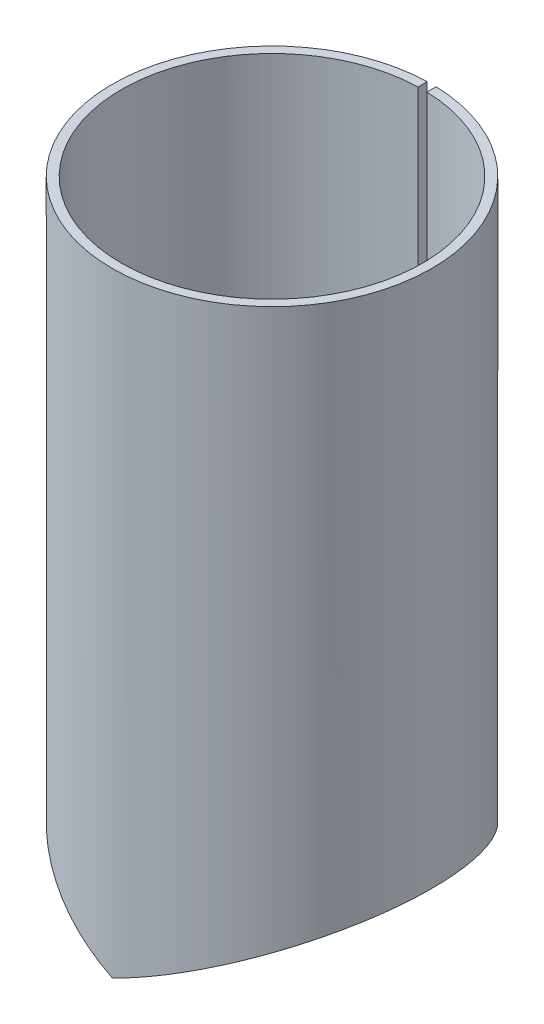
ISO-10303-21;
HEADER;
FILE_DESCRIPTION(('STEP AP214'),'2;1');
FILE_NAME('part.step','',(''),(''),'','','');
FILE_SCHEMA(('AUTOMOTIVE_DESIGN { 1 0 10303 214 1 1 1 1 }'));
ENDSEC;
DATA;
#1=APPLICATION_CONTEXT('core data for automotive mechanical design processes');
#2=APPLICATION_PROTOCOL_DEFINITION('international standard','automotive_design',2000,#1);
#3=PRODUCT_CONTEXT('',#1,'mechanical');
#4=PRODUCT('Part','Part','',(#3));
#5=PRODUCT_RELATED_PRODUCT_CATEGORY('part','',(#4));
#6=PRODUCT_DEFINITION_FORMATION('','',#4);
#7=PRODUCT_DEFINITION_CONTEXT('part definition',#1,'design');
#8=PRODUCT_DEFINITION('design','',#6,#7);
#9=PRODUCT_DEFINITION_SHAPE('','',#8);
#10=(LENGTH_UNIT() NAMED_UNIT(*) SI_UNIT(.MILLI.,.METRE.));
#11=(NAMED_UNIT(*) PLANE_ANGLE_UNIT() SI_UNIT($,.RADIAN.));
#12=(NAMED_UNIT(*) SI_UNIT($,.STERADIAN.) SOLID_ANGLE_UNIT());
#13=UNCERTAINTY_MEASURE_WITH_UNIT(LENGTH_MEASURE(1.E-05),#10,'distance_accuracy_value','');
#14=(GEOMETRIC_REPRESENTATION_CONTEXT(3) GLOBAL_UNCERTAINTY_ASSIGNED_CONTEXT((#13)) GLOBAL_UNIT_ASSIGNED_CONTEXT((#10,
#11,#12)) REPRESENTATION_CONTEXT('',''));
#15=CARTESIAN_POINT('',(0.,0.,0.));
#16=DIRECTION('',(0.,0.,1.));
#17=DIRECTION('',(1.,0.,0.));
#18=AXIS2_PLACEMENT_3D('',#15,#16,#17);
#19=CARTESIAN_POINT('',(0.,67.2886666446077,0.));
#20=DIRECTION('',(0.,-1.,0.));
#21=DIRECTION('',(0.,0.,-1.));
#22=AXIS2_PLACEMENT_3D('',#19,#20,#21);
#23=PLANE('',#22);
#24=DIRECTION('',(0.0285968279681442,0.,-0.999591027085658));
#25=VECTOR('',#24,1.);
#26=CARTESIAN_POINT('',(0.471403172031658,67.2886666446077,-16.4777149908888));
#27=LINE('',#26,#25);
#28=CARTESIAN_POINT('',(0.471403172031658,67.2886666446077,-16.4777149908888));
#29=VERTEX_POINT('',#28);
#30=CARTESIAN_POINT('',(0.499999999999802,67.2886666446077,-17.4773060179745));
#31=VERTEX_POINT('',#30);
#32=EDGE_CURVE('E13',#29,#31,#27,.T.);
#33=ORIENTED_EDGE('',*,*,#32,.F.);
#34=CARTESIAN_POINT('',(0.,67.2886666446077,0.));
#35=DIRECTION('',(0.,1.,0.));
#36=DIRECTION('',(0.,0.,1.));
#37=AXIS2_PLACEMENT_3D('',#34,#35,#36);
#38=CIRCLE('',#37,16.4844566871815);
#39=CARTESIAN_POINT('',(-0.471403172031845,67.2886666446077,-16.4777149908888));
#40=VERTEX_POINT('',#39);
#41=EDGE_CURVE('E85',#40,#29,#38,.T.);
#42=ORIENTED_EDGE('',*,*,#41,.F.);
#43=DIRECTION('',(-0.028596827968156,0.,-0.999591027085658));
#44=VECTOR('',#43,1.);
#45=CARTESIAN_POINT('',(-0.471403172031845,67.2886666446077,-16.4777149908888));
#46=LINE('',#45,#44);
#47=CARTESIAN_POINT('',(-0.499999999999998,67.2886666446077,-17.4773060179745));
#48=VERTEX_POINT('',#47);
#49=EDGE_CURVE('E50',#40,#48,#46,.T.);
#50=ORIENTED_EDGE('',*,*,#49,.T.);
#51=CARTESIAN_POINT('',(0.,67.2886666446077,0.));
#52=DIRECTION('',(0.,-1.,0.));
#53=DIRECTION('',(0.,0.,-1.));
#54=AXIS2_PLACEMENT_3D('',#51,#52,#53);
#55=CIRCLE('',#54,17.4844566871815);
#56=EDGE_CURVE('E87',#48,#31,#55,.F.);
#57=ORIENTED_EDGE('',*,*,#56,.T.);
#58=EDGE_LOOP('',(#33,#42,#50,#57));
#59=FACE_BOUND('',#58,.T.);
#60=ADVANCED_FACE('F38',(#59),#23,.F.);
#61=CARTESIAN_POINT('',(-0.471403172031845,33.7656054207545,-16.4777149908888));
#62=DIRECTION('',(-0.999591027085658,0.,0.028596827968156));
#63=DIRECTION('',(0.,1.,0.));
#64=AXIS2_PLACEMENT_3D('',#61,#62,#63);
#65=PLANE('',#64);
#66=ORIENTED_EDGE('',*,*,#49,.F.);
#67=DIRECTION('',(0.,1.,0.));
#68=VECTOR('',#67,1.);
#69=CARTESIAN_POINT('',(-0.471403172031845,0.242544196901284,-16.4777149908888));
#70=LINE('',#69,#68);
#71=CARTESIAN_POINT('',(-0.471403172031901,0.242544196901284,-16.4777149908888));
#72=VERTEX_POINT('',#71);
#73=EDGE_CURVE('E95',#72,#40,#70,.T.);
#74=ORIENTED_EDGE('',*,*,#73,.F.);
#75=CARTESIAN_POINT('',(-0.50000000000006,0.242544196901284,-17.4773060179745));
#76=CARTESIAN_POINT('',(-0.471403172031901,0.242544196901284,-16.4777149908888));
#77=B_SPLINE_CURVE_WITH_KNOTS('',1,(#75,#76),.UNSPECIFIED.,.F.,.F.,(2,2),(0.,1.),.UNSPECIFIED.);
#78=CARTESIAN_POINT('',(-0.499999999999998,0.242544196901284,-17.4773060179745));
#79=VERTEX_POINT('',#78);
#80=EDGE_CURVE('E225',#72,#79,#77,.F.);
#81=ORIENTED_EDGE('',*,*,#80,.T.);
#82=DIRECTION('',(0.,-1.,0.));
#83=VECTOR('',#82,1.);
#84=CARTESIAN_POINT('',(-0.499999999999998,190.064149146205,-17.4773060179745));
#85=LINE('',#84,#83);
#86=EDGE_CURVE('E156',#79,#48,#85,.F.);
#87=ORIENTED_EDGE('',*,*,#86,.T.);
#88=EDGE_LOOP('',(#66,#74,#81,#87));
#89=FACE_BOUND('',#88,.T.);
#90=ADVANCED_FACE('F191',(#89),#65,.F.);
#91=CARTESIAN_POINT('',(2.15527506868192E-13,2.22044604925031E-13,17.4844566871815));
#92=CARTESIAN_POINT('',(-0.815625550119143,0.395643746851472,17.4844566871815));
#93=CARTESIAN_POINT('',(-1.51365633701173,0.733701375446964,17.4285612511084));
#94=CARTESIAN_POINT('',(-2.38160178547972,1.1549225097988,17.323946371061));
#95=CARTESIAN_POINT('',(-2.64116191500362,1.28099012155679,17.2853956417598));
#96=CARTESIAN_POINT('',(-2.98631097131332,1.44858238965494,17.2279359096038));
#97=CARTESIAN_POINT('',(-3.09399928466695,1.50086162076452,17.2088296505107));
#98=CARTESIAN_POINT('',(-3.29475718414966,1.59825036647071,17.1715236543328));
#99=CARTESIAN_POINT('',(-3.39367810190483,1.64622851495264,17.1522362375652));
#100=CARTESIAN_POINT('',(-4.2770174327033,2.0746414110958,16.9721973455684));
#101=CARTESIAN_POINT('',(-4.99777183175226,2.42416894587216,16.7692832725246));
#102=CARTESIAN_POINT('',(-5.81758003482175,2.82197345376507,16.4891482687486));
#103=CARTESIAN_POINT('',(-5.97750654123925,2.8995791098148,16.4317791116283));
#104=CARTESIAN_POINT('',(-6.28935283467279,3.05087993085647,16.3149621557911));
#105=CARTESIAN_POINT('',(-6.44109429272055,3.12448300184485,16.2556095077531));
#106=CARTESIAN_POINT('',(-6.8918074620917,3.34309130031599,16.0721640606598));
#107=CARTESIAN_POINT('',(-7.18380200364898,3.48469853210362,15.9435715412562));
#108=CARTESIAN_POINT('',(-8.03411540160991,3.89712532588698,15.5419513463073));
#109=CARTESIAN_POINT('',(-8.56669271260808,4.15554998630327,15.253132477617));
#110=CARTESIAN_POINT('',(-9.31464484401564,4.5183971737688,14.7996158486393));
#111=CARTESIAN_POINT('',(-9.5559485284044,4.63542575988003,14.644826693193));
#112=CARTESIAN_POINT('',(-10.0271664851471,4.86397511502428,14.3263056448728));
#113=CARTESIAN_POINT('',(-10.2564168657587,4.97517003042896,14.1629678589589));
#114=CARTESIAN_POINT('',(-10.9250416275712,5.29951549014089,13.6623486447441));
#115=CARTESIAN_POINT('',(-11.3452570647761,5.50342674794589,13.3144829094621));
#116=CARTESIAN_POINT('',(-12.1351979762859,5.88661116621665,12.5987016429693));
#117=CARTESIAN_POINT('',(-12.5068575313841,6.06682578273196,12.2291727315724));
#118=CARTESIAN_POINT('',(-13.2083924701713,6.40712415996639,11.4678907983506));
#119=CARTESIAN_POINT('',(-13.5374742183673,6.56680521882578,11.076849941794));
#120=CARTESIAN_POINT('',(-14.1525595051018,6.86523107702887,10.2793420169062));
#121=CARTESIAN_POINT('',(-14.4385856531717,7.00393810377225,9.87303668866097));
#122=CARTESIAN_POINT('',(-14.9723231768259,7.26280876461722,9.04318239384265));
#123=CARTESIAN_POINT('',(-15.2194123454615,7.38267424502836,8.62039044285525));
#124=CARTESIAN_POINT('',(-15.6740586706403,7.60326550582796,7.76308755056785));
#125=CARTESIAN_POINT('',(-15.8813018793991,7.70385101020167,7.32934947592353));
#126=CARTESIAN_POINT('',(-16.2583398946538,7.88662170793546,6.44992224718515));
#127=CARTESIAN_POINT('',(-16.42823265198,7.96888003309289,6.00379382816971));
#128=CARTESIAN_POINT('',(-16.8813157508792,8.18827393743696,4.65101872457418));
#129=CARTESIAN_POINT('',(-17.1077778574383,8.29802844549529,3.73000996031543));
#130=CARTESIAN_POINT('',(-17.3336854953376,8.40789806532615,2.33886206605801));
#131=CARTESIAN_POINT('',(-17.3900575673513,8.43539424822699,1.87353445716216));
#132=CARTESIAN_POINT('',(-17.4652647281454,8.47213256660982,0.942741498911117));
#133=CARTESIAN_POINT('',(-17.4841075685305,8.48136899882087,0.478005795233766));
#134=CARTESIAN_POINT('',(-17.4851405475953,8.48173838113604,-0.917175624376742));
#135=CARTESIAN_POINT('',(-17.4114515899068,8.4455598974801,-1.85230489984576));
#136=CARTESIAN_POINT('',(-17.1125304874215,8.30035345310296,-3.70823141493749));
#137=CARTESIAN_POINT('',(-16.8872880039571,8.1913254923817,-4.62900688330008));
#138=CARTESIAN_POINT('',(-16.2865314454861,7.90042009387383,-6.43094816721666));
#139=CARTESIAN_POINT('',(-15.912325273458,7.71882463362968,-7.31067360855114));
#140=CARTESIAN_POINT('',(-15.2322190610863,7.38888978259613,-8.59774288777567));
#141=CARTESIAN_POINT('',(-14.9859130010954,7.26943138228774,-9.02060572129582));
#142=CARTESIAN_POINT('',(-14.4542183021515,7.0115543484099,-9.85010098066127));
#143=CARTESIAN_POINT('',(-14.1688110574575,6.87308617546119,-10.256937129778));
#144=CARTESIAN_POINT('',(-13.5547961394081,6.57517706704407,-11.0556532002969));
#145=CARTESIAN_POINT('',(-13.2266404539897,6.41598603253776,-11.446785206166));
#146=CARTESIAN_POINT('',(-12.5279976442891,6.07713100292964,-12.2074642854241));
#147=CARTESIAN_POINT('',(-12.1585707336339,5.89796073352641,-12.5761587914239));
#148=CARTESIAN_POINT('',(-11.3695332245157,5.51512322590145,-13.2937702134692));
#149=CARTESIAN_POINT('',(-10.950429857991,5.31178054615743,-13.641943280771));
#150=CARTESIAN_POINT('',(-10.2846972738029,4.98888063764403,-14.1424292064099));
#151=CARTESIAN_POINT('',(-10.0566145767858,4.87826635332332,-14.3056242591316));
#152=CARTESIAN_POINT('',(-9.58817237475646,4.65107582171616,-14.6237249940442));
#153=CARTESIAN_POINT('',(-9.3472918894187,4.53422860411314,-14.7790239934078));
#154=CARTESIAN_POINT('',(-8.59955297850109,4.17147525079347,-15.2346537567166));
#155=CARTESIAN_POINT('',(-8.06941325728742,3.91431198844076,-15.5234572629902));
#156=CARTESIAN_POINT('',(-7.36719606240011,3.57369829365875,-15.8573273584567));
#157=CARTESIAN_POINT('',(-7.22478075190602,3.50461757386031,-15.9227416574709));
#158=CARTESIAN_POINT('',(-6.93602881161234,3.36454017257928,-16.0506281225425));
#159=CARTESIAN_POINT('',(-6.79013430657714,3.29375565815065,-16.112923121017));
#160=CARTESIAN_POINT('',(-6.34273854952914,3.07666500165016,-16.2966208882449));
#161=CARTESIAN_POINT('',(-6.03135157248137,2.92555633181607,-16.4148402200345));
#162=CARTESIAN_POINT('',(-5.38207535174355,2.61057586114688,-16.6390338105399));
#163=CARTESIAN_POINT('',(-5.04418366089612,2.44670406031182,-16.7450073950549));
#164=CARTESIAN_POINT('',(-4.5175459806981,2.19132401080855,-16.8917498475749));
#165=CARTESIAN_POINT('',(-4.3387031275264,2.1046019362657,-16.9386254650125));
#166=CARTESIAN_POINT('',(-4.06553343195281,1.97212573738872,-17.0054829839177));
#167=CARTESIAN_POINT('',(-3.97365951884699,1.92756815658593,-17.027192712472));
#168=CARTESIAN_POINT('',(-3.78828642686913,1.83765529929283,-17.0693921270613));
#169=CARTESIAN_POINT('',(-3.69586606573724,1.79282765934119,-17.0896607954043));
#170=CARTESIAN_POINT('',(-3.21381146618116,1.55890711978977,-17.1910716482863));
#171=CARTESIAN_POINT('',(-2.76326025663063,1.34004729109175,-17.2725776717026));
#172=CARTESIAN_POINT('',(-1.73012688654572,0.838880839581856,-17.4064415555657));
#173=CARTESIAN_POINT('',(-1.14751221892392,0.556618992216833,-17.4587816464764));
#174=CARTESIAN_POINT('',(-0.50000000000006,0.242544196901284,-17.4773060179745));
#175=CARTESIAN_POINT('',(2.03414633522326E-13,2.22044604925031E-13,16.4844566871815));
#176=CARTESIAN_POINT('',(-0.768971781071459,0.395641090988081,16.4844566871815));
#177=CARTESIAN_POINT('',(-1.42708479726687,0.733701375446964,16.4317581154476));
#178=CARTESIAN_POINT('',(-2.24538927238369,1.1549225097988,16.3331265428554));
#179=CARTESIAN_POINT('',(-2.49010420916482,1.28099012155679,16.2967806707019));
#180=CARTESIAN_POINT('',(-2.81551292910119,1.44858238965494,16.2426072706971));
#181=CARTESIAN_POINT('',(-2.91704215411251,1.50086162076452,16.2245937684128));
#182=CARTESIAN_POINT('',(-3.10631797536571,1.59825036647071,16.1894214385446));
#183=CARTESIAN_POINT('',(-3.19958124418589,1.64622851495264,16.1712371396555));
#184=CARTESIAN_POINT('',(-4.03239916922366,2.0746414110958,16.0014953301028));
#185=CARTESIAN_POINT('',(-4.71193098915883,2.42416894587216,15.8101866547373));
#186=CARTESIAN_POINT('',(-5.4848513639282,2.82197345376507,15.546073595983));
#187=CARTESIAN_POINT('',(-5.63563108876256,2.8995791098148,15.4919855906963));
#188=CARTESIAN_POINT('',(-5.92964175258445,3.05087993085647,15.3818498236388));
#189=CARTESIAN_POINT('',(-6.07270456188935,3.12448300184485,15.3258917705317));
#190=CARTESIAN_POINT('',(-6.49763979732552,3.34309130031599,15.1529382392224));
#191=CARTESIAN_POINT('',(-6.77293410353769,3.48469853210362,15.0317003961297));
#192=CARTESIAN_POINT('',(-7.57461496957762,3.89712532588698,14.6530503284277));
#193=CARTESIAN_POINT('',(-8.07673223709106,4.15554998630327,14.3807500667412));
#194=CARTESIAN_POINT('',(-8.78190625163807,4.5183971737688,13.9531717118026));
#195=CARTESIAN_POINT('',(-9.00940889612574,4.63542575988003,13.8072355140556));
#196=CARTESIAN_POINT('',(-9.45367617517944,4.86397511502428,13.5069318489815));
#197=CARTESIAN_POINT('',(-9.66981488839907,4.97517003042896,13.3529359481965));
#198=CARTESIAN_POINT('',(-10.300198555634,5.29951549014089,12.8809489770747));
#199=CARTESIAN_POINT('',(-10.6963803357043,5.50342674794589,12.5529789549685));
#200=CARTESIAN_POINT('',(-11.4411416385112,5.88661116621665,11.8781358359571));
#201=CARTESIAN_POINT('',(-11.7915446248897,6.06682578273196,11.5297416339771));
#202=CARTESIAN_POINT('',(-12.4529562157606,6.40712415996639,10.8120001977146));
#203=CARTESIAN_POINT('',(-12.7632165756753,6.56680521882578,10.4433243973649));
#204=CARTESIAN_POINT('',(-13.3431228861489,6.86523107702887,9.69142886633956));
#205=CARTESIAN_POINT('',(-13.6127901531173,7.00393810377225,9.30836162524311));
#206=CARTESIAN_POINT('',(-14.1160012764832,7.26280876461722,8.5259697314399));
#207=CARTESIAN_POINT('',(-14.3489585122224,7.38267424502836,8.12735879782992));
#208=CARTESIAN_POINT('',(-14.7776019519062,7.60326550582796,7.31908819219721));
#209=CARTESIAN_POINT('',(-14.972992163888,7.70385101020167,6.91015718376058));
#210=CARTESIAN_POINT('',(-15.3284659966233,7.88662170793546,6.08102761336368));
#211=CARTESIAN_POINT('',(-15.488641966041,7.96888003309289,5.66041490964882));
#212=CARTESIAN_POINT('',(-15.9158115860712,8.18827393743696,4.38500995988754));
#213=CARTESIAN_POINT('',(-16.1293214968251,8.29802844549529,3.51667705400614));
#214=CARTESIAN_POINT('',(-16.342308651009,8.40789806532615,2.2050939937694));
#215=CARTESIAN_POINT('',(-16.3954565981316,8.43539424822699,1.76638017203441));
#216=CARTESIAN_POINT('',(-16.4663623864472,8.47213256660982,0.888822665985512));
#217=CARTESIAN_POINT('',(-16.4841275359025,8.48136899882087,0.450666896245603));
#218=CARTESIAN_POINT('',(-16.4851014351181,8.48173838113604,-0.864718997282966));
#219=CARTESIAN_POINT('',(-16.4156270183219,8.4455598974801,-1.74636481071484));
#220=CARTESIAN_POINT('',(-16.1338023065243,8.30035345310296,-3.49614410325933));
#221=CARTESIAN_POINT('',(-15.9214422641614,8.1913254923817,-4.36425705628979));
#222=CARTESIAN_POINT('',(-15.355045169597,7.90042009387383,-6.06313873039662));
#223=CARTESIAN_POINT('',(-15.0022412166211,7.71882463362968,-6.89254945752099));
#224=CARTESIAN_POINT('',(-14.36103276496,7.38888978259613,-8.10600653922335));
#225=CARTESIAN_POINT('',(-14.1288138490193,7.26943138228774,-8.5046843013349));
#226=CARTESIAN_POINT('',(-13.6275287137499,7.0115543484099,-9.2867376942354));
#227=CARTESIAN_POINT('',(-13.3584449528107,6.87308617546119,-9.67030539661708));
#228=CARTESIAN_POINT('',(-12.779547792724,6.57517706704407,-10.423339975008));
#229=CARTESIAN_POINT('',(-12.470160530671,6.41598603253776,-10.7921017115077));
#230=CARTESIAN_POINT('',(-11.8114756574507,6.07713100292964,-11.5092747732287));
#231=CARTESIAN_POINT('',(-11.4631776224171,5.89796073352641,-11.8568822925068));
#232=CARTESIAN_POINT('',(-10.7192680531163,5.51512322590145,-12.5334508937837));
#233=CARTESIAN_POINT('',(-10.3241347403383,5.31178054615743,-12.8617106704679));
#234=CARTESIAN_POINT('',(-9.69647783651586,4.98888063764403,-13.3335719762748));
#235=CARTESIAN_POINT('',(-9.48144002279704,4.87826635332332,-13.4874333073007));
#236=CARTESIAN_POINT('',(-9.03978974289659,4.65107582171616,-13.7873406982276));
#237=CARTESIAN_POINT('',(-8.81268609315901,4.53422860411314,-13.9337575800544));
#238=CARTESIAN_POINT('',(-8.10771310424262,4.17147525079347,-14.3633282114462));
#239=CARTESIAN_POINT('',(-7.60789401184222,3.91431198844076,-14.6356139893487));
#240=CARTESIAN_POINT('',(-6.94583918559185,3.57369829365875,-14.9503888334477));
#241=CARTESIAN_POINT('',(-6.81156912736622,3.50461757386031,-15.0120618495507));
#242=CARTESIAN_POINT('',(-6.53933196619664,3.36454017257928,-15.1326340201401));
#243=CARTESIAN_POINT('',(-6.40178170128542,3.29375565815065,-15.1913661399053));
#244=CARTESIAN_POINT('',(-5.97997414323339,3.07666500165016,-15.3645575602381));
#245=CARTESIAN_POINT('',(-5.68639652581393,2.92555633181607,-15.4760154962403));
#246=CARTESIAN_POINT('',(-5.07425478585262,2.61057586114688,-15.6873866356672));
#247=CARTESIAN_POINT('',(-4.75568835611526,2.44670406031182,-15.7872992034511));
#248=CARTESIAN_POINT('',(-4.25917101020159,2.19132401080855,-15.9256489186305));
#249=CARTESIAN_POINT('',(-4.09055683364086,2.1046019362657,-15.9698435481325));
#250=CARTESIAN_POINT('',(-3.83301071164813,1.97212573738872,-16.0328772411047));
#251=CARTESIAN_POINT('',(-3.74639140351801,1.92756815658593,-16.0533453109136));
#252=CARTESIAN_POINT('',(-3.57162047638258,1.83765529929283,-16.0931311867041));
#253=CARTESIAN_POINT('',(-3.48448597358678,1.79282765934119,-16.1122406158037));
#254=CARTESIAN_POINT('',(-3.03000183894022,1.55890711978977,-16.2078514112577));
#255=CARTESIAN_POINT('',(-2.60521930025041,1.34004729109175,-16.284695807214));
#256=CARTESIAN_POINT('',(-1.63117460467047,0.838880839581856,-16.4109035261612));
#257=CARTESIAN_POINT('',(-1.08187977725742,0.556617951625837,-16.4602501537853));
#258=CARTESIAN_POINT('',(-0.471403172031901,0.242544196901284,-16.4777149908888));
#259=B_SPLINE_SURFACE_WITH_KNOTS('',1,3,((#91,#92,#93,#94,#95,#96,#97,#98,#99,#100,#101,#102,
#103,#104,#105,#106,#107,#108,#109,#110,#111,#112,#113,#114,#115,#116,#117,#118,#119,#120,#121,
#122,#123,#124,#125,#126,#127,#128,#129,#130,#131,#132,#133,#134,#135,#136,#137,#138,#139,#140,
#141,#142,#143,#144,#145,#146,#147,#148,#149,#150,#151,#152,#153,#154,#155,#156,#157,#158,#159,
#160,#161,#162,#163,#164,#165,#166,#167,#168,#169,#170,#171,#172,#173,#174),(#175,#176,#177,
#178,#179,#180,#181,#182,#183,#184,#185,#186,#187,#188,#189,#190,#191,#192,#193,#194,#195,#196,
#197,#198,#199,#200,#201,#202,#203,#204,#205,#206,#207,#208,#209,#210,#211,#212,#213,#214,#215,
#216,#217,#218,#219,#220,#221,#222,#223,#224,#225,#226,#227,#228,#229,#230,#231,#232,#233,#234,
#235,#236,#237,#238,#239,#240,#241,#242,#243,#244,#245,#246,#247,#248,#249,#250,#251,#252,#253,
#254,#255,#256,#257,#258)),.UNSPECIFIED.,.F.,.F.,.F.,(2,2),(4,2,2,2,2,2,2,2,2,2,2,2,2,2,2,2,2,2,
2,2,2,2,2,2,2,2,2,2,2,2,2,2,2,2,2,2,2,2,2,2,2,4),(0.,1.),(0.,0.015625,0.0234375,0.02734375,
0.03125,0.0625,0.0703125,0.078125,0.09375,0.125,0.140625,0.15625,0.1875,0.21875,0.25,0.28125,
0.3125,0.34375,0.375,0.4375,0.46875,0.5,0.5625,0.625,0.6875,0.71875,0.75,0.78125,0.8125,0.84375,
0.859375,0.875,0.90625,0.9140625,0.921875,0.9375,0.953125,0.9609375,0.96484375,0.96875,0.984375,
1.),.UNSPECIFIED.);
#260=CARTESIAN_POINT('',(-0.471403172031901,0.242544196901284,-16.4777149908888));
#261=CARTESIAN_POINT('',(-1.08187977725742,0.556617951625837,-16.4602501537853));
#262=CARTESIAN_POINT('',(-1.63117460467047,0.838880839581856,-16.4109035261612));
#263=CARTESIAN_POINT('',(-2.60521930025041,1.34004729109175,-16.284695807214));
#264=CARTESIAN_POINT('',(-3.03000183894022,1.55890711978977,-16.2078514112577));
#265=CARTESIAN_POINT('',(-3.48448597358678,1.79282765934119,-16.1122406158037));
#266=CARTESIAN_POINT('',(-3.57162047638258,1.83765529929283,-16.0931311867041));
#267=CARTESIAN_POINT('',(-3.74639140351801,1.92756815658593,-16.0533453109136));
#268=CARTESIAN_POINT('',(-3.83301071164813,1.97212573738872,-16.0328772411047));
#269=CARTESIAN_POINT('',(-4.09055683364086,2.1046019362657,-15.9698435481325));
#270=CARTESIAN_POINT('',(-4.25917101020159,2.19132401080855,-15.9256489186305));
#271=CARTESIAN_POINT('',(-4.75568835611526,2.44670406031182,-15.7872992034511));
#272=CARTESIAN_POINT('',(-5.07425478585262,2.61057586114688,-15.6873866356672));
#273=CARTESIAN_POINT('',(-5.68639652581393,2.92555633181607,-15.4760154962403));
#274=CARTESIAN_POINT('',(-5.97997414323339,3.07666500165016,-15.3645575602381));
#275=CARTESIAN_POINT('',(-6.40178170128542,3.29375565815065,-15.1913661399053));
#276=CARTESIAN_POINT('',(-6.53933196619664,3.36454017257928,-15.1326340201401));
#277=CARTESIAN_POINT('',(-6.81156912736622,3.50461757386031,-15.0120618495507));
#278=CARTESIAN_POINT('',(-6.94583918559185,3.57369829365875,-14.9503888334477));
#279=CARTESIAN_POINT('',(-7.60789401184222,3.91431198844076,-14.6356139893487));
#280=CARTESIAN_POINT('',(-8.10771310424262,4.17147525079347,-14.3633282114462));
#281=CARTESIAN_POINT('',(-8.81268609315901,4.53422860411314,-13.9337575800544));
#282=CARTESIAN_POINT('',(-9.03978974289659,4.65107582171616,-13.7873406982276));
#283=CARTESIAN_POINT('',(-9.48144002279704,4.87826635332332,-13.4874333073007));
#284=CARTESIAN_POINT('',(-9.69647783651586,4.98888063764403,-13.3335719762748));
#285=CARTESIAN_POINT('',(-10.3241347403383,5.31178054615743,-12.8617106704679));
#286=CARTESIAN_POINT('',(-10.7192680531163,5.51512322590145,-12.5334508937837));
#287=CARTESIAN_POINT('',(-11.4631776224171,5.89796073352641,-11.8568822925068));
#288=CARTESIAN_POINT('',(-11.8114756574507,6.07713100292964,-11.5092747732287));
#289=CARTESIAN_POINT('',(-12.470160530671,6.41598603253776,-10.7921017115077));
#290=CARTESIAN_POINT('',(-12.779547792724,6.57517706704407,-10.423339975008));
#291=CARTESIAN_POINT('',(-13.3584449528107,6.87308617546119,-9.67030539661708));
#292=CARTESIAN_POINT('',(-13.6275287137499,7.0115543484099,-9.2867376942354));
#293=CARTESIAN_POINT('',(-14.1288138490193,7.26943138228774,-8.5046843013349));
#294=CARTESIAN_POINT('',(-14.36103276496,7.38888978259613,-8.10600653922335));
#295=CARTESIAN_POINT('',(-15.0022412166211,7.71882463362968,-6.89254945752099));
#296=CARTESIAN_POINT('',(-15.355045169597,7.90042009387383,-6.06313873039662));
#297=CARTESIAN_POINT('',(-15.9214422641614,8.1913254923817,-4.36425705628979));
#298=CARTESIAN_POINT('',(-16.1338023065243,8.30035345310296,-3.49614410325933));
#299=CARTESIAN_POINT('',(-16.4156270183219,8.4455598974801,-1.74636481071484));
#300=CARTESIAN_POINT('',(-16.4851014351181,8.48173838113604,-0.864718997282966));
#301=CARTESIAN_POINT('',(-16.4841275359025,8.48136899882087,0.450666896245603));
#302=CARTESIAN_POINT('',(-16.4663623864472,8.47213256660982,0.888822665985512));
#303=CARTESIAN_POINT('',(-16.3954565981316,8.43539424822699,1.76638017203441));
#304=CARTESIAN_POINT('',(-16.342308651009,8.40789806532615,2.2050939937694));
#305=CARTESIAN_POINT('',(-16.1293214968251,8.29802844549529,3.51667705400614));
#306=CARTESIAN_POINT('',(-15.9158115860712,8.18827393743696,4.38500995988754));
#307=CARTESIAN_POINT('',(-15.488641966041,7.96888003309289,5.66041490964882));
#308=CARTESIAN_POINT('',(-15.3284659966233,7.88662170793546,6.08102761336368));
#309=CARTESIAN_POINT('',(-14.972992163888,7.70385101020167,6.91015718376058));
#310=CARTESIAN_POINT('',(-14.7776019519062,7.60326550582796,7.31908819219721));
#311=CARTESIAN_POINT('',(-14.3489585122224,7.38267424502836,8.12735879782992));
#312=CARTESIAN_POINT('',(-14.1160012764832,7.26280876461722,8.5259697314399));
#313=CARTESIAN_POINT('',(-13.6127901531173,7.00393810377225,9.30836162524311));
#314=CARTESIAN_POINT('',(-13.3431228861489,6.86523107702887,9.69142886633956));
#315=CARTESIAN_POINT('',(-12.7632165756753,6.56680521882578,10.4433243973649));
#316=CARTESIAN_POINT('',(-12.4529562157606,6.40712415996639,10.8120001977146));
#317=CARTESIAN_POINT('',(-11.7915446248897,6.06682578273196,11.5297416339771));
#318=CARTESIAN_POINT('',(-11.4411416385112,5.88661116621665,11.8781358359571));
#319=CARTESIAN_POINT('',(-10.6963803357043,5.50342674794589,12.5529789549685));
#320=CARTESIAN_POINT('',(-10.300198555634,5.29951549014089,12.8809489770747));
#321=CARTESIAN_POINT('',(-9.66981488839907,4.97517003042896,13.3529359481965));
#322=CARTESIAN_POINT('',(-9.45367617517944,4.86397511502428,13.5069318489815));
#323=CARTESIAN_POINT('',(-9.00940889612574,4.63542575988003,13.8072355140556));
#324=CARTESIAN_POINT('',(-8.78190625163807,4.5183971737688,13.9531717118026));
#325=CARTESIAN_POINT('',(-8.07673223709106,4.15554998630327,14.3807500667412));
#326=CARTESIAN_POINT('',(-7.57461496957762,3.89712532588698,14.6530503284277));
#327=CARTESIAN_POINT('',(-6.77293410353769,3.48469853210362,15.0317003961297));
#328=CARTESIAN_POINT('',(-6.49763979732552,3.34309130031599,15.1529382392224));
#329=CARTESIAN_POINT('',(-6.07270456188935,3.12448300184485,15.3258917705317));
#330=CARTESIAN_POINT('',(-5.92964175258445,3.05087993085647,15.3818498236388));
#331=CARTESIAN_POINT('',(-5.63563108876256,2.8995791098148,15.4919855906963));
#332=CARTESIAN_POINT('',(-5.4848513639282,2.82197345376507,15.546073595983));
#333=CARTESIAN_POINT('',(-4.71193098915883,2.42416894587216,15.8101866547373));
#334=CARTESIAN_POINT('',(-4.03239916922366,2.0746414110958,16.0014953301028));
#335=CARTESIAN_POINT('',(-3.19958124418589,1.64622851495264,16.1712371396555));
#336=CARTESIAN_POINT('',(-3.10631797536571,1.59825036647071,16.1894214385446));
#337=CARTESIAN_POINT('',(-2.91704215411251,1.50086162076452,16.2245937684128));
#338=CARTESIAN_POINT('',(-2.81551292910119,1.44858238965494,16.2426072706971));
#339=CARTESIAN_POINT('',(-2.49010420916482,1.28099012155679,16.2967806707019));
#340=CARTESIAN_POINT('',(-2.24538927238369,1.1549225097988,16.3331265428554));
#341=CARTESIAN_POINT('',(-1.42708479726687,0.733701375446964,16.4317581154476));
#342=CARTESIAN_POINT('',(-0.768971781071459,0.395641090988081,16.4844566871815));
#343=CARTESIAN_POINT('',(2.03414633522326E-13,2.22044604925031E-13,16.4844566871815));
#344=B_SPLINE_CURVE_WITH_KNOTS('',3,(#260,#261,#262,#263,#264,#265,#266,#267,#268,#269,#270,
#271,#272,#273,#274,#275,#276,#277,#278,#279,#280,#281,#282,#283,#284,#285,#286,#287,#288,#289,
#290,#291,#292,#293,#294,#295,#296,#297,#298,#299,#300,#301,#302,#303,#304,#305,#306,#307,#308,
#309,#310,#311,#312,#313,#314,#315,#316,#317,#318,#319,#320,#321,#322,#323,#324,#325,#326,#327,
#328,#329,#330,#331,#332,#333,#334,#335,#336,#337,#338,#339,#340,#341,#342,#343),.UNSPECIFIED.,
.F.,.F.,(4,2,2,2,2,2,2,2,2,2,2,2,2,2,2,2,2,2,2,2,2,2,2,2,2,2,2,2,2,2,2,2,2,2,2,2,2,2,2,2,2,4),
(0.,0.015625,0.03125,0.03515625,0.0390625,0.046875,0.0625,0.078125,0.0859375,0.09375,0.125,
0.140625,0.15625,0.1875,0.21875,0.25,0.28125,0.3125,0.375,0.4375,0.5,0.53125,0.5625,0.625,
0.65625,0.6875,0.71875,0.75,0.78125,0.8125,0.84375,0.859375,0.875,0.90625,0.921875,0.9296875,
0.9375,0.96875,0.97265625,0.9765625,0.984375,1.),.UNSPECIFIED.);
#345=CARTESIAN_POINT('',(2.03414633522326E-13,2.22044604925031E-13,16.4844566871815));
#346=VERTEX_POINT('',#345);
#347=EDGE_CURVE('E169',#346,#72,#344,.F.);
#348=CARTESIAN_POINT('',(2.03414633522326E-13,2.22044604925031E-13,16.4844566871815));
#349=CARTESIAN_POINT('',(2.15527506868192E-13,2.22044604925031E-13,17.4844566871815));
#350=B_SPLINE_CURVE_WITH_KNOTS('',1,(#348,#349),.UNSPECIFIED.,.F.,.F.,(2,2),(0.,1.),.UNSPECIFIED.);
#351=CARTESIAN_POINT('',(-5.15396699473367E-07,2.50009013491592E-07,17.4844566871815));
#352=VERTEX_POINT('',#351);
#353=EDGE_CURVE('E155',#346,#352,#350,.T.);
#354=CARTESIAN_POINT('',(2.15527506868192E-13,2.22044604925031E-13,17.4844566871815));
#355=CARTESIAN_POINT('',(-0.815625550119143,0.395643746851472,17.4844566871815));
#356=CARTESIAN_POINT('',(-1.51365633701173,0.733701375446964,17.4285612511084));
#357=CARTESIAN_POINT('',(-2.38160178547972,1.1549225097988,17.323946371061));
#358=CARTESIAN_POINT('',(-2.64116191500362,1.28099012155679,17.2853956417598));
#359=CARTESIAN_POINT('',(-2.98631097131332,1.44858238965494,17.2279359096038));
#360=CARTESIAN_POINT('',(-3.09399928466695,1.50086162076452,17.2088296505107));
#361=CARTESIAN_POINT('',(-3.29475718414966,1.59825036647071,17.1715236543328));
#362=CARTESIAN_POINT('',(-3.39367810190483,1.64622851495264,17.1522362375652));
#363=CARTESIAN_POINT('',(-4.2770174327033,2.0746414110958,16.9721973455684));
#364=CARTESIAN_POINT('',(-4.99777183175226,2.42416894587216,16.7692832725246));
#365=CARTESIAN_POINT('',(-5.81758003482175,2.82197345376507,16.4891482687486));
#366=CARTESIAN_POINT('',(-5.97750654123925,2.8995791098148,16.4317791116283));
#367=CARTESIAN_POINT('',(-6.28935283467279,3.05087993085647,16.3149621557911));
#368=CARTESIAN_POINT('',(-6.44109429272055,3.12448300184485,16.2556095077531));
#369=CARTESIAN_POINT('',(-6.8918074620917,3.34309130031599,16.0721640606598));
#370=CARTESIAN_POINT('',(-7.18380200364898,3.48469853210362,15.9435715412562));
#371=CARTESIAN_POINT('',(-8.03411540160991,3.89712532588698,15.5419513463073));
#372=CARTESIAN_POINT('',(-8.56669271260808,4.15554998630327,15.253132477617));
#373=CARTESIAN_POINT('',(-9.31464484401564,4.5183971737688,14.7996158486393));
#374=CARTESIAN_POINT('',(-9.5559485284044,4.63542575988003,14.644826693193));
#375=CARTESIAN_POINT('',(-10.0271664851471,4.86397511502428,14.3263056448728));
#376=CARTESIAN_POINT('',(-10.2564168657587,4.97517003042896,14.1629678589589));
#377=CARTESIAN_POINT('',(-10.9250416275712,5.29951549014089,13.6623486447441));
#378=CARTESIAN_POINT('',(-11.3452570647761,5.50342674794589,13.3144829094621));
#379=CARTESIAN_POINT('',(-12.1351979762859,5.88661116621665,12.5987016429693));
#380=CARTESIAN_POINT('',(-12.5068575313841,6.06682578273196,12.2291727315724));
#381=CARTESIAN_POINT('',(-13.2083924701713,6.40712415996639,11.4678907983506));
#382=CARTESIAN_POINT('',(-13.5374742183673,6.56680521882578,11.076849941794));
#383=CARTESIAN_POINT('',(-14.1525595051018,6.86523107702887,10.2793420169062));
#384=CARTESIAN_POINT('',(-14.4385856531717,7.00393810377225,9.87303668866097));
#385=CARTESIAN_POINT('',(-14.9723231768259,7.26280876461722,9.04318239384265));
#386=CARTESIAN_POINT('',(-15.2194123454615,7.38267424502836,8.62039044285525));
#387=CARTESIAN_POINT('',(-15.6740586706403,7.60326550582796,7.76308755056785));
#388=CARTESIAN_POINT('',(-15.8813018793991,7.70385101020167,7.32934947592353));
#389=CARTESIAN_POINT('',(-16.2583398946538,7.88662170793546,6.44992224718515));
#390=CARTESIAN_POINT('',(-16.42823265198,7.96888003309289,6.00379382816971));
#391=CARTESIAN_POINT('',(-16.8813157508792,8.18827393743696,4.65101872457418));
#392=CARTESIAN_POINT('',(-17.1077778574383,8.29802844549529,3.73000996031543));
#393=CARTESIAN_POINT('',(-17.3336854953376,8.40789806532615,2.33886206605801));
#394=CARTESIAN_POINT('',(-17.3900575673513,8.43539424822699,1.87353445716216));
#395=CARTESIAN_POINT('',(-17.4652647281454,8.47213256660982,0.942741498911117));
#396=CARTESIAN_POINT('',(-17.4841075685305,8.48136899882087,0.478005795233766));
#397=CARTESIAN_POINT('',(-17.4851405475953,8.48173838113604,-0.917175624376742));
#398=CARTESIAN_POINT('',(-17.4114515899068,8.4455598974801,-1.85230489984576));
#399=CARTESIAN_POINT('',(-17.1125304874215,8.30035345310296,-3.70823141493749));
#400=CARTESIAN_POINT('',(-16.8872880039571,8.1913254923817,-4.62900688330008));
#401=CARTESIAN_POINT('',(-16.2865314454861,7.90042009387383,-6.43094816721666));
#402=CARTESIAN_POINT('',(-15.912325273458,7.71882463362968,-7.31067360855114));
#403=CARTESIAN_POINT('',(-15.2322190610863,7.38888978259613,-8.59774288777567));
#404=CARTESIAN_POINT('',(-14.9859130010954,7.26943138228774,-9.02060572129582));
#405=CARTESIAN_POINT('',(-14.4542183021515,7.0115543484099,-9.85010098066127));
#406=CARTESIAN_POINT('',(-14.1688110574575,6.87308617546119,-10.256937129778));
#407=CARTESIAN_POINT('',(-13.5547961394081,6.57517706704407,-11.0556532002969));
#408=CARTESIAN_POINT('',(-13.2266404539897,6.41598603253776,-11.446785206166));
#409=CARTESIAN_POINT('',(-12.5279976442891,6.07713100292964,-12.2074642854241));
#410=CARTESIAN_POINT('',(-12.1585707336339,5.89796073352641,-12.5761587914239));
#411=CARTESIAN_POINT('',(-11.3695332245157,5.51512322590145,-13.2937702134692));
#412=CARTESIAN_POINT('',(-10.950429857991,5.31178054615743,-13.641943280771));
#413=CARTESIAN_POINT('',(-10.2846972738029,4.98888063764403,-14.1424292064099));
#414=CARTESIAN_POINT('',(-10.0566145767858,4.87826635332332,-14.3056242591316));
#415=CARTESIAN_POINT('',(-9.58817237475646,4.65107582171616,-14.6237249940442));
#416=CARTESIAN_POINT('',(-9.3472918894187,4.53422860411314,-14.7790239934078));
#417=CARTESIAN_POINT('',(-8.59955297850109,4.17147525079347,-15.2346537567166));
#418=CARTESIAN_POINT('',(-8.06941325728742,3.91431198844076,-15.5234572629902));
#419=CARTESIAN_POINT('',(-7.36719606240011,3.57369829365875,-15.8573273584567));
#420=CARTESIAN_POINT('',(-7.22478075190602,3.50461757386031,-15.9227416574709));
#421=CARTESIAN_POINT('',(-6.93602881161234,3.36454017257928,-16.0506281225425));
#422=CARTESIAN_POINT('',(-6.79013430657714,3.29375565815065,-16.112923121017));
#423=CARTESIAN_POINT('',(-6.34273854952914,3.07666500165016,-16.2966208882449));
#424=CARTESIAN_POINT('',(-6.03135157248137,2.92555633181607,-16.4148402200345));
#425=CARTESIAN_POINT('',(-5.38207535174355,2.61057586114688,-16.6390338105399));
#426=CARTESIAN_POINT('',(-5.04418366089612,2.44670406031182,-16.7450073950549));
#427=CARTESIAN_POINT('',(-4.5175459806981,2.19132401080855,-16.8917498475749));
#428=CARTESIAN_POINT('',(-4.3387031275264,2.1046019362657,-16.9386254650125));
#429=CARTESIAN_POINT('',(-4.06553343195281,1.97212573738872,-17.0054829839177));
#430=CARTESIAN_POINT('',(-3.97365951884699,1.92756815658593,-17.027192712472));
#431=CARTESIAN_POINT('',(-3.78828642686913,1.83765529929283,-17.0693921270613));
#432=CARTESIAN_POINT('',(-3.69586606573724,1.79282765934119,-17.0896607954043));
#433=CARTESIAN_POINT('',(-3.21381146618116,1.55890711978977,-17.1910716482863));
#434=CARTESIAN_POINT('',(-2.76326025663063,1.34004729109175,-17.2725776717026));
#435=CARTESIAN_POINT('',(-1.73012688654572,0.838880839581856,-17.4064415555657));
#436=CARTESIAN_POINT('',(-1.14751221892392,0.556618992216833,-17.4587816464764));
#437=CARTESIAN_POINT('',(-0.50000000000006,0.242544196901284,-17.4773060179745));
#438=B_SPLINE_CURVE_WITH_KNOTS('',3,(#354,#355,#356,#357,#358,#359,#360,#361,#362,#363,#364,
#365,#366,#367,#368,#369,#370,#371,#372,#373,#374,#375,#376,#377,#378,#379,#380,#381,#382,#383,
#384,#385,#386,#387,#388,#389,#390,#391,#392,#393,#394,#395,#396,#397,#398,#399,#400,#401,#402,
#403,#404,#405,#406,#407,#408,#409,#410,#411,#412,#413,#414,#415,#416,#417,#418,#419,#420,#421,
#422,#423,#424,#425,#426,#427,#428,#429,#430,#431,#432,#433,#434,#435,#436,#437),.UNSPECIFIED.,
.F.,.F.,(4,2,2,2,2,2,2,2,2,2,2,2,2,2,2,2,2,2,2,2,2,2,2,2,2,2,2,2,2,2,2,2,2,2,2,2,2,2,2,2,2,4),
(0.,0.015625,0.0234375,0.02734375,0.03125,0.0625,0.0703125,0.078125,0.09375,0.125,0.140625,
0.15625,0.1875,0.21875,0.25,0.28125,0.3125,0.34375,0.375,0.4375,0.46875,0.5,0.5625,0.625,0.6875,
0.71875,0.75,0.78125,0.8125,0.84375,0.859375,0.875,0.90625,0.9140625,0.921875,0.9375,0.953125,
0.9609375,0.96484375,0.96875,0.984375,1.),.UNSPECIFIED.);
#439=EDGE_CURVE('E102',#352,#79,#438,.T.);
#440=ORIENTED_EDGE('',*,*,#80,.F.);
#441=ORIENTED_EDGE('',*,*,#347,.F.);
#442=ORIENTED_EDGE('',*,*,#353,.T.);
#443=ORIENTED_EDGE('',*,*,#439,.T.);
#444=EDGE_LOOP('',(#440,#441,#442,#443));
#445=FACE_BOUND('',#444,.T.);
#446=ADVANCED_FACE('F180',(#445),#259,.F.);
#447=CARTESIAN_POINT('',(0.499999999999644,0.242544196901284,-17.4773060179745));
#448=CARTESIAN_POINT('',(1.14755537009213,0.556639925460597,-17.458780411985));
#449=CARTESIAN_POINT('',(1.72986524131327,0.838758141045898,-17.4064481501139));
#450=CARTESIAN_POINT('',(2.7617182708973,1.33930929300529,-17.2728047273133));
#451=CARTESIAN_POINT('',(3.21129475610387,1.55769727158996,-17.1915112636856));
#452=CARTESIAN_POINT('',(3.69173169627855,1.79082274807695,-17.0905524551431));
#453=CARTESIAN_POINT('',(3.78371191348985,1.83543373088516,-17.0704042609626));
#454=CARTESIAN_POINT('',(3.96823200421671,1.9249277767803,-17.0284559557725));
#455=CARTESIAN_POINT('',(4.05968451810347,1.96927874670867,-17.0068778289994));
#456=CARTESIAN_POINT('',(4.33160557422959,2.10114349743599,-16.9404322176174));
#457=CARTESIAN_POINT('',(4.50963675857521,2.18746911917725,-16.8938540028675));
#458=CARTESIAN_POINT('',(5.03390324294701,2.44169334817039,-16.7480640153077));
#459=CARTESIAN_POINT('',(5.37029939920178,2.60483931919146,-16.6428056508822));
#460=CARTESIAN_POINT('',(6.01675852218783,2.91845756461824,-16.4201617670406));
#461=CARTESIAN_POINT('',(6.32682389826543,3.06892983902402,-16.3027769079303));
#462=CARTESIAN_POINT('',(6.7723662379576,3.28513297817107,-16.1203918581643));
#463=CARTESIAN_POINT('',(6.9175587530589,3.35558184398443,-16.0585893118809));
#464=CARTESIAN_POINT('',(7.20501706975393,3.49503655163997,-15.9316866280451));
#465=CARTESIAN_POINT('',(7.34683401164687,3.56382785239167,-15.8667646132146));
#466=CARTESIAN_POINT('',(8.04629664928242,3.90310409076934,-15.5353388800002));
#467=CARTESIAN_POINT('',(8.57499479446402,4.15954823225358,-15.2484328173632));
#468=CARTESIAN_POINT('',(9.57044629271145,4.64248281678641,-14.6441727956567));
#469=CARTESIAN_POINT('',(10.0364452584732,4.86850387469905,-14.3277093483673));
#470=CARTESIAN_POINT('',(10.9238464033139,5.29892248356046,-13.6632012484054));
#471=CARTESIAN_POINT('',(11.343117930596,5.50232997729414,-13.3162997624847));
#472=CARTESIAN_POINT('',(12.1329718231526,5.88554134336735,-12.6008395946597));
#473=CARTESIAN_POINT('',(12.5029821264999,6.06499426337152,-12.2330684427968));
#474=CARTESIAN_POINT('',(13.2026923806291,6.40435991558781,-11.4743818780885));
#475=CARTESIAN_POINT('',(13.5314377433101,6.56383418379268,-11.0842145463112));
#476=CARTESIAN_POINT('',(14.1467311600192,6.86236560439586,-10.2873522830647));
#477=CARTESIAN_POINT('',(14.4328264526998,7.00117709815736,-9.88139721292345));
#478=CARTESIAN_POINT('',(14.9658699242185,7.25971370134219,-9.05379631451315));
#479=CARTESIAN_POINT('',(15.2129256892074,7.37953251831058,-8.63181605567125));
#480=CARTESIAN_POINT('',(15.6679526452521,7.60027118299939,-7.77538528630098));
#481=CARTESIAN_POINT('',(15.8759248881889,7.70119103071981,-7.34093578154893));
#482=CARTESIAN_POINT('',(16.2529988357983,7.8841317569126,-6.46330859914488));
#483=CARTESIAN_POINT('',(16.422642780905,7.96633796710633,-6.01898622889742));
#484=CARTESIAN_POINT('',(16.8760742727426,8.1859147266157,-4.66958292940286));
#485=CARTESIAN_POINT('',(17.1033923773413,8.29593569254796,-3.74999851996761));
#486=CARTESIAN_POINT('',(17.4067103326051,8.44325054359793,-1.89603668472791));
#487=CARTESIAN_POINT('',(17.4827203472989,8.48054442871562,-0.961680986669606));
#488=CARTESIAN_POINT('',(17.4852806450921,8.4819399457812,0.432683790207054));
#489=CARTESIAN_POINT('',(17.4676640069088,8.47330795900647,0.896966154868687));
#490=CARTESIAN_POINT('',(17.3949858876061,8.43779770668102,1.82710156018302));
#491=CARTESIAN_POINT('',(17.3399117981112,8.41092684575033,2.29216066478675));
#492=CARTESIAN_POINT('',(17.1179798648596,8.30296705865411,3.68269671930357));
#493=CARTESIAN_POINT('',(16.8942776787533,8.19453092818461,4.60355652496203));
#494=CARTESIAN_POINT('',(16.4454152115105,7.97718232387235,5.95653636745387));
#495=CARTESIAN_POINT('',(16.2769426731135,7.89561705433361,6.40280422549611));
#496=CARTESIAN_POINT('',(15.902756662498,7.7142550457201,7.28265715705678));
#497=CARTESIAN_POINT('',(15.6970388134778,7.61442088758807,7.71648459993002));
#498=CARTESIAN_POINT('',(15.245428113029,7.39530283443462,8.57426870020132));
#499=CARTESIAN_POINT('',(14.9998589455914,7.27616968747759,8.99741199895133));
#500=CARTESIAN_POINT('',(14.4691346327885,7.01875515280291,9.82819078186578));
#501=CARTESIAN_POINT('',(14.1845913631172,6.88077244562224,10.2350670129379));
#502=CARTESIAN_POINT('',(13.5727328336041,6.58391755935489,11.0335919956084));
#503=CARTESIAN_POINT('',(13.2452704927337,6.42501817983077,11.4252524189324));
#504=CARTESIAN_POINT('',(12.5469576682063,6.08627554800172,12.1880037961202));
#505=CARTESIAN_POINT('',(12.1767600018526,5.9067678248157,12.5585012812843));
#506=CARTESIAN_POINT('',(11.3904361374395,5.52534773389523,13.275820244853));
#507=CARTESIAN_POINT('',(10.9718255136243,5.32219476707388,13.6247972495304));
#508=CARTESIAN_POINT('',(10.3051966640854,4.99880093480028,14.1275123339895));
#509=CARTESIAN_POINT('',(10.0765431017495,4.88789226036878,14.2916199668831));
#510=CARTESIAN_POINT('',(9.60636534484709,4.65985345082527,14.6118057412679));
#511=CARTESIAN_POINT('',(9.36542400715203,4.54301501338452,14.7675321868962));
#512=CARTESIAN_POINT('',(8.61931843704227,4.18110484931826,15.2234479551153));
#513=CARTESIAN_POINT('',(8.08719829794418,3.92287510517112,15.5144570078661));
#514=CARTESIAN_POINT('',(7.23618789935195,3.51009603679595,15.9198788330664));
#515=CARTESIAN_POINT('',(6.94373100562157,3.36826393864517,16.0498235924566));
#516=CARTESIAN_POINT('',(6.49195707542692,3.14915717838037,16.2353694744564));
#517=CARTESIAN_POINT('',(6.33983256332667,3.07537971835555,16.2954158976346));
#518=CARTESIAN_POINT('',(6.02774682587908,2.92397914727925,16.4134190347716));
#519=CARTESIAN_POINT('',(5.86753749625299,2.8462382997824,16.4714443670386));
#520=CARTESIAN_POINT('',(5.04547160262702,2.44733125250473,16.7551020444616));
#521=CARTESIAN_POINT('',(4.32019346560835,2.09555662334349,16.9616374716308));
#522=CARTESIAN_POINT('',(3.42843596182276,1.6630800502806,17.1453284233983));
#523=CARTESIAN_POINT('',(3.3283051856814,1.61451695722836,17.1650577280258));
#524=CARTESIAN_POINT('',(3.1259631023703,1.51637049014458,17.2030571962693));
#525=CARTESIAN_POINT('',(3.01939438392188,1.46464709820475,17.2221698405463));
#526=CARTESIAN_POINT('',(2.67375326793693,1.29682644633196,17.2803898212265));
#527=CARTESIAN_POINT('',(2.41277720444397,1.17006516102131,17.3196760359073));
#528=CARTESIAN_POINT('',(1.53723883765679,0.745138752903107,17.4266722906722));
#529=CARTESIAN_POINT('',(0.829660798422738,0.402452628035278,17.4844566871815));
#530=CARTESIAN_POINT('',(2.15527506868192E-13,2.22044604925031E-13,17.4844566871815));
#531=CARTESIAN_POINT('',(0.471403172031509,0.242544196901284,-16.4777149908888));
#532=CARTESIAN_POINT('',(1.08192045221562,0.556638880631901,-16.4602489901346));
#533=CARTESIAN_POINT('',(1.63092792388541,0.838758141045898,-16.410909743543));
#534=CARTESIAN_POINT('',(2.60376550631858,1.33930929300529,-16.2849098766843));
#535=CARTESIAN_POINT('',(3.02762906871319,1.55769727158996,-16.2082658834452));
#536=CARTESIAN_POINT('',(3.48058806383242,1.79082274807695,-16.1130812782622));
#537=CARTESIAN_POINT('',(3.56730759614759,1.83543373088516,-16.0940854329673));
#538=CARTESIAN_POINT('',(3.74127430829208,1.9249277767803,-16.0545363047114));
#539=CARTESIAN_POINT('',(3.82749631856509,1.96927874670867,-16.0341923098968));
#540=CARTESIAN_POINT('',(4.08386521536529,2.10114349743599,-15.9715469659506));
#541=CARTESIAN_POINT('',(4.25171414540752,2.18746911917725,-15.9276327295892));
#542=CARTESIAN_POINT('',(4.74599591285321,2.44169334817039,-15.7901810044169));
#543=CARTESIAN_POINT('',(5.06315234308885,2.60483931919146,-15.6909427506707));
#544=CARTESIAN_POINT('',(5.67263810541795,2.91845756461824,-15.4810326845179));
#545=CARTESIAN_POINT('',(5.96496970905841,3.06892983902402,-15.3703614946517));
#546=CARTESIAN_POINT('',(6.38502985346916,3.28513297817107,-15.1984077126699));
#547=CARTESIAN_POINT('',(6.52191827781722,3.35558184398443,-15.1401398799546));
#548=CARTESIAN_POINT('',(6.79293580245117,3.49503655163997,-15.0204952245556));
#549=CARTESIAN_POINT('',(6.92664171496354,3.56382785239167,-14.9592863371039));
#550=CARTESIAN_POINT('',(7.58609952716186,3.90310409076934,-14.6468160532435));
#551=CARTESIAN_POINT('',(8.08455949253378,4.15954823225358,-14.376319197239));
#552=CARTESIAN_POINT('',(9.02307748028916,4.64248281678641,-13.80661901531));
#553=CARTESIAN_POINT('',(9.46242426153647,4.86850387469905,-13.5082552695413));
#554=CARTESIAN_POINT('',(10.2990716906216,5.29892248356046,-12.8817528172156));
#555=CARTESIAN_POINT('',(10.6943635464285,5.50232997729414,-12.5546918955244));
#556=CARTESIAN_POINT('',(11.4390428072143,5.88554134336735,-11.8801515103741));
#557=CARTESIAN_POINT('',(11.787890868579,6.06499426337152,-11.5334145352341));
#558=CARTESIAN_POINT('',(12.4475821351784,6.40435991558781,-10.8181200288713));
#559=CARTESIAN_POINT('',(12.7575253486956,6.56383418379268,-10.4502677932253));
#560=CARTESIAN_POINT('',(13.3376278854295,6.86236560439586,-9.6989809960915));
#561=CARTESIAN_POINT('',(13.6073603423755,7.00117709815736,-9.31624398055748));
#562=CARTESIAN_POINT('',(14.1099171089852,7.25971370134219,-8.53597660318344));
#563=CARTESIAN_POINT('',(14.3428428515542,7.37953251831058,-8.13813093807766));
#564=CARTESIAN_POINT('',(14.7718451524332,7.60027118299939,-7.33068257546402));
#565=CARTESIAN_POINT('',(14.9679227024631,7.70119103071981,-6.92108082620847));
#566=CARTESIAN_POINT('',(15.3234304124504,7.8841317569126,-6.09364835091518));
#567=CARTESIAN_POINT('',(15.483371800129,7.96633796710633,-5.67473840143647));
#568=CARTESIAN_POINT('',(15.9108698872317,8.1859147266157,-4.40251240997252));
#569=CARTESIAN_POINT('',(16.1251868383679,8.29593569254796,-3.53552239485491));
#570=CARTESIAN_POINT('',(16.411156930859,8.44325054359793,-1.78759541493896));
#571=CARTESIAN_POINT('',(16.4828196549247,8.48054442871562,-0.906678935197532));
#572=CARTESIAN_POINT('',(16.4852335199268,8.4819399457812,0.407937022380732));
#573=CARTESIAN_POINT('',(16.4686244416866,8.47330795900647,0.845665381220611));
#574=CARTESIAN_POINT('',(16.4001030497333,8.43779770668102,1.72260294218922));
#575=CARTESIAN_POINT('',(16.348178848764,8.41092684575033,2.16106361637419));
#576=CARTESIAN_POINT('',(16.1389400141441,8.30296705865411,3.47206983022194));
#577=CARTESIAN_POINT('',(15.9280321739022,8.19453092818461,4.34026229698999));
#578=CARTESIAN_POINT('',(15.5048417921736,7.97718232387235,5.61586027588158));
#579=CARTESIAN_POINT('',(15.3460048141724,7.89561705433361,6.03660444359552));
#580=CARTESIAN_POINT('',(14.9932198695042,7.7142550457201,6.86613536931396));
#581=CARTESIAN_POINT('',(14.7992677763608,7.61442088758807,7.27515063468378));
#582=CARTESIAN_POINT('',(14.3734863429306,7.39530283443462,8.08387492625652));
#583=CARTESIAN_POINT('',(14.141962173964,7.27616968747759,8.48281711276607));
#584=CARTESIAN_POINT('',(13.6415919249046,7.01875515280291,9.26608061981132));
#585=CARTESIAN_POINT('',(13.3733227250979,6.88077244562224,9.64968611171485));
#586=CARTESIAN_POINT('',(12.7964586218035,6.58391755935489,10.4025405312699));
#587=CARTESIAN_POINT('',(12.4877250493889,6.42501817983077,10.7718004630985));
#588=CARTESIAN_POINT('',(11.8293512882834,6.08627554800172,11.4909273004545));
#589=CARTESIAN_POINT('',(11.4803265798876,5.9067678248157,11.8402346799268));
#590=CARTESIAN_POINT('',(10.7389754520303,5.52534773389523,12.5165275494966));
#591=CARTESIAN_POINT('',(10.3443067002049,5.32219476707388,12.8455452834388));
#592=CARTESIAN_POINT('',(9.71580479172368,4.99880093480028,13.3195082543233));
#593=CARTESIAN_POINT('',(9.50022876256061,4.88789226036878,13.4742299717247));
#594=CARTESIAN_POINT('',(9.0569421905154,4.65985345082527,13.7761031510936));
#595=CARTESIAN_POINT('',(8.82978116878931,4.54301501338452,13.9229230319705));
#596=CARTESIAN_POINT('',(8.12634810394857,4.18110484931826,14.3527633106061));
#597=CARTESIAN_POINT('',(7.62466186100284,3.92287510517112,14.6271284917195));
#598=CARTESIAN_POINT('',(6.82232385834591,3.51009603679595,15.0093627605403));
#599=CARTESIAN_POINT('',(6.54659364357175,3.36826393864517,15.1318755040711));
#600=CARTESIAN_POINT('',(6.12065831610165,3.14915717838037,15.3068093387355));
#601=CARTESIAN_POINT('',(5.97723436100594,3.07537971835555,15.3634214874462));
#602=CARTESIAN_POINT('',(5.68299794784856,2.92397914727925,15.4746755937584));
#603=CARTESIAN_POINT('',(5.53195157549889,2.8462382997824,15.5293822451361));
#604=CARTESIAN_POINT('',(4.75690263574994,2.44733125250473,15.7968165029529));
#605=CARTESIAN_POINT('',(4.07310580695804,2.09555662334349,15.9915394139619));
#606=CARTESIAN_POINT('',(3.23235117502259,1.6630800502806,16.1647244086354));
#607=CARTESIAN_POINT('',(3.13794724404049,1.61451695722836,16.1833253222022));
#608=CARTESIAN_POINT('',(2.94717784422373,1.51637049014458,16.2191514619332));
#609=CARTESIAN_POINT('',(2.84670418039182,1.46464709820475,16.2371709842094));
#610=CARTESIAN_POINT('',(2.52083154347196,1.29682644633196,16.292061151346));
#611=CARTESIAN_POINT('',(2.27478165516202,1.17006516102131,16.3291004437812));
#612=CARTESIAN_POINT('',(1.44931852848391,0.745138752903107,16.4299771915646));
#613=CARTESIAN_POINT('',(0.782203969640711,0.402449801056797,16.4844566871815));
#614=CARTESIAN_POINT('',(2.03414633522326E-13,2.22044604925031E-13,16.4844566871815));
#615=B_SPLINE_SURFACE_WITH_KNOTS('',1,3,((#447,#448,#449,#450,#451,#452,#453,#454,#455,#456,
#457,#458,#459,#460,#461,#462,#463,#464,#465,#466,#467,#468,#469,#470,#471,#472,#473,#474,#475,
#476,#477,#478,#479,#480,#481,#482,#483,#484,#485,#486,#487,#488,#489,#490,#491,#492,#493,#494,
#495,#496,#497,#498,#499,#500,#501,#502,#503,#504,#505,#506,#507,#508,#509,#510,#511,#512,#513,
#514,#515,#516,#517,#518,#519,#520,#521,#522,#523,#524,#525,#526,#527,#528,#529,#530),(#531,
#532,#533,#534,#535,#536,#537,#538,#539,#540,#541,#542,#543,#544,#545,#546,#547,#548,#549,#550,
#551,#552,#553,#554,#555,#556,#557,#558,#559,#560,#561,#562,#563,#564,#565,#566,#567,#568,#569,
#570,#571,#572,#573,#574,#575,#576,#577,#578,#579,#580,#581,#582,#583,#584,#585,#586,#587,#588,
#589,#590,#591,#592,#593,#594,#595,#596,#597,#598,#599,#600,#601,#602,#603,#604,#605,#606,#607,
#608,#609,#610,#611,#612,#613,#614)),.UNSPECIFIED.,.F.,.F.,.F.,(2,2),(4,2,2,2,2,2,2,2,2,2,2,2,2,
2,2,2,2,2,2,2,2,2,2,2,2,2,2,2,2,2,2,2,2,2,2,2,2,2,2,2,2,4),(0.,1.),(0.,0.015625,0.03125,
0.03515625,0.0390625,0.046875,0.0625,0.078125,0.0859375,0.09375,0.125,0.15625,0.1875,0.21875,
0.25,0.28125,0.3125,0.34375,0.375,0.4375,0.5,0.53125,0.5625,0.625,0.65625,0.6875,0.71875,0.75,
0.78125,0.8125,0.84375,0.859375,0.875,0.90625,0.921875,0.9296875,0.9375,0.96875,0.97265625,
0.9765625,0.984375,1.),.UNSPECIFIED.);
#616=CARTESIAN_POINT('',(2.03414633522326E-13,2.22044604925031E-13,16.4844566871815));
#617=CARTESIAN_POINT('',(0.782203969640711,0.402449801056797,16.4844566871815));
#618=CARTESIAN_POINT('',(1.44931852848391,0.745138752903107,16.4299771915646));
#619=CARTESIAN_POINT('',(2.27478165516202,1.17006516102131,16.3291004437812));
#620=CARTESIAN_POINT('',(2.52083154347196,1.29682644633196,16.292061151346));
#621=CARTESIAN_POINT('',(2.84670418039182,1.46464709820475,16.2371709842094));
#622=CARTESIAN_POINT('',(2.94717784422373,1.51637049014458,16.2191514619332));
#623=CARTESIAN_POINT('',(3.13794724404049,1.61451695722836,16.1833253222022));
#624=CARTESIAN_POINT('',(3.23235117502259,1.6630800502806,16.1647244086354));
#625=CARTESIAN_POINT('',(4.07310580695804,2.09555662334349,15.9915394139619));
#626=CARTESIAN_POINT('',(4.75690263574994,2.44733125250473,15.7968165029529));
#627=CARTESIAN_POINT('',(5.53195157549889,2.8462382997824,15.5293822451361));
#628=CARTESIAN_POINT('',(5.68299794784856,2.92397914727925,15.4746755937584));
#629=CARTESIAN_POINT('',(5.97723436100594,3.07537971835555,15.3634214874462));
#630=CARTESIAN_POINT('',(6.12065831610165,3.14915717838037,15.3068093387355));
#631=CARTESIAN_POINT('',(6.54659364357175,3.36826393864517,15.1318755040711));
#632=CARTESIAN_POINT('',(6.82232385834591,3.51009603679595,15.0093627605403));
#633=CARTESIAN_POINT('',(7.62466186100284,3.92287510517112,14.6271284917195));
#634=CARTESIAN_POINT('',(8.12634810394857,4.18110484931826,14.3527633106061));
#635=CARTESIAN_POINT('',(8.82978116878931,4.54301501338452,13.9229230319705));
#636=CARTESIAN_POINT('',(9.0569421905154,4.65985345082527,13.7761031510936));
#637=CARTESIAN_POINT('',(9.50022876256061,4.88789226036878,13.4742299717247));
#638=CARTESIAN_POINT('',(9.71580479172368,4.99880093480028,13.3195082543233));
#639=CARTESIAN_POINT('',(10.3443067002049,5.32219476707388,12.8455452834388));
#640=CARTESIAN_POINT('',(10.7389754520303,5.52534773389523,12.5165275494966));
#641=CARTESIAN_POINT('',(11.4803265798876,5.9067678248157,11.8402346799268));
#642=CARTESIAN_POINT('',(11.8293512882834,6.08627554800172,11.4909273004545));
#643=CARTESIAN_POINT('',(12.4877250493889,6.42501817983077,10.7718004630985));
#644=CARTESIAN_POINT('',(12.7964586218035,6.58391755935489,10.4025405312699));
#645=CARTESIAN_POINT('',(13.3733227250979,6.88077244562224,9.64968611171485));
#646=CARTESIAN_POINT('',(13.6415919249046,7.01875515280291,9.26608061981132));
#647=CARTESIAN_POINT('',(14.141962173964,7.27616968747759,8.48281711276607));
#648=CARTESIAN_POINT('',(14.3734863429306,7.39530283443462,8.08387492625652));
#649=CARTESIAN_POINT('',(14.7992677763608,7.61442088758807,7.27515063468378));
#650=CARTESIAN_POINT('',(14.9932198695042,7.7142550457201,6.86613536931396));
#651=CARTESIAN_POINT('',(15.3460048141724,7.89561705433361,6.03660444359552));
#652=CARTESIAN_POINT('',(15.5048417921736,7.97718232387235,5.61586027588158));
#653=CARTESIAN_POINT('',(15.9280321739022,8.19453092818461,4.34026229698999));
#654=CARTESIAN_POINT('',(16.1389400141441,8.30296705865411,3.47206983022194));
#655=CARTESIAN_POINT('',(16.348178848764,8.41092684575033,2.16106361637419));
#656=CARTESIAN_POINT('',(16.4001030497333,8.43779770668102,1.72260294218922));
#657=CARTESIAN_POINT('',(16.4686244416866,8.47330795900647,0.845665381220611));
#658=CARTESIAN_POINT('',(16.4852335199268,8.4819399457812,0.407937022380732));
#659=CARTESIAN_POINT('',(16.4828196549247,8.48054442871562,-0.906678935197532));
#660=CARTESIAN_POINT('',(16.411156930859,8.44325054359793,-1.78759541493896));
#661=CARTESIAN_POINT('',(16.1251868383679,8.29593569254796,-3.53552239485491));
#662=CARTESIAN_POINT('',(15.9108698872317,8.1859147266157,-4.40251240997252));
#663=CARTESIAN_POINT('',(15.483371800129,7.96633796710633,-5.67473840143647));
#664=CARTESIAN_POINT('',(15.3234304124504,7.8841317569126,-6.09364835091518));
#665=CARTESIAN_POINT('',(14.9679227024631,7.70119103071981,-6.92108082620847));
#666=CARTESIAN_POINT('',(14.7718451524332,7.60027118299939,-7.33068257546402));
#667=CARTESIAN_POINT('',(14.3428428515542,7.37953251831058,-8.13813093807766));
#668=CARTESIAN_POINT('',(14.1099171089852,7.25971370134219,-8.53597660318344));
#669=CARTESIAN_POINT('',(13.6073603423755,7.00117709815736,-9.31624398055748));
#670=CARTESIAN_POINT('',(13.3376278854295,6.86236560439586,-9.6989809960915));
#671=CARTESIAN_POINT('',(12.7575253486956,6.56383418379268,-10.4502677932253));
#672=CARTESIAN_POINT('',(12.4475821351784,6.40435991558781,-10.8181200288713));
#673=CARTESIAN_POINT('',(11.787890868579,6.06499426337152,-11.5334145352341));
#674=CARTESIAN_POINT('',(11.4390428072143,5.88554134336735,-11.8801515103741));
#675=CARTESIAN_POINT('',(10.6943635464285,5.50232997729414,-12.5546918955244));
#676=CARTESIAN_POINT('',(10.2990716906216,5.29892248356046,-12.8817528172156));
#677=CARTESIAN_POINT('',(9.46242426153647,4.86850387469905,-13.5082552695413));
#678=CARTESIAN_POINT('',(9.02307748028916,4.64248281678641,-13.80661901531));
#679=CARTESIAN_POINT('',(8.08455949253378,4.15954823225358,-14.376319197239));
#680=CARTESIAN_POINT('',(7.58609952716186,3.90310409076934,-14.6468160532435));
#681=CARTESIAN_POINT('',(6.92664171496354,3.56382785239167,-14.9592863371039));
#682=CARTESIAN_POINT('',(6.79293580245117,3.49503655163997,-15.0204952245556));
#683=CARTESIAN_POINT('',(6.52191827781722,3.35558184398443,-15.1401398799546));
#684=CARTESIAN_POINT('',(6.38502985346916,3.28513297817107,-15.1984077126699));
#685=CARTESIAN_POINT('',(5.96496970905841,3.06892983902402,-15.3703614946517));
#686=CARTESIAN_POINT('',(5.67263810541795,2.91845756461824,-15.4810326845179));
#687=CARTESIAN_POINT('',(5.06315234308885,2.60483931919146,-15.6909427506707));
#688=CARTESIAN_POINT('',(4.74599591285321,2.44169334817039,-15.7901810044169));
#689=CARTESIAN_POINT('',(4.25171414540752,2.18746911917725,-15.9276327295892));
#690=CARTESIAN_POINT('',(4.08386521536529,2.10114349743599,-15.9715469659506));
#691=CARTESIAN_POINT('',(3.82749631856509,1.96927874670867,-16.0341923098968));
#692=CARTESIAN_POINT('',(3.74127430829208,1.9249277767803,-16.0545363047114));
#693=CARTESIAN_POINT('',(3.56730759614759,1.83543373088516,-16.0940854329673));
#694=CARTESIAN_POINT('',(3.48058806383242,1.79082274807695,-16.1130812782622));
#695=CARTESIAN_POINT('',(3.02762906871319,1.55769727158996,-16.2082658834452));
#696=CARTESIAN_POINT('',(2.60376550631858,1.33930929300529,-16.2849098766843));
#697=CARTESIAN_POINT('',(1.63092792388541,0.838758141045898,-16.410909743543));
#698=CARTESIAN_POINT('',(1.08192045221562,0.556638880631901,-16.4602489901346));
#699=CARTESIAN_POINT('',(0.471403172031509,0.242544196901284,-16.4777149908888));
#700=B_SPLINE_CURVE_WITH_KNOTS('',3,(#616,#617,#618,#619,#620,#621,#622,#623,#624,#625,#626,
#627,#628,#629,#630,#631,#632,#633,#634,#635,#636,#637,#638,#639,#640,#641,#642,#643,#644,#645,
#646,#647,#648,#649,#650,#651,#652,#653,#654,#655,#656,#657,#658,#659,#660,#661,#662,#663,#664,
#665,#666,#667,#668,#669,#670,#671,#672,#673,#674,#675,#676,#677,#678,#679,#680,#681,#682,#683,
#684,#685,#686,#687,#688,#689,#690,#691,#692,#693,#694,#695,#696,#697,#698,#699),.UNSPECIFIED.,
.F.,.F.,(4,2,2,2,2,2,2,2,2,2,2,2,2,2,2,2,2,2,2,2,2,2,2,2,2,2,2,2,2,2,2,2,2,2,2,2,2,2,2,2,2,4),
(0.,0.015625,0.0234375,0.02734375,0.03125,0.0625,0.0703125,0.078125,0.09375,0.125,0.140625,
0.15625,0.1875,0.21875,0.25,0.28125,0.3125,0.34375,0.375,0.4375,0.46875,0.5,0.5625,0.625,
0.65625,0.6875,0.71875,0.75,0.78125,0.8125,0.84375,0.875,0.90625,0.9140625,0.921875,0.9375,
0.953125,0.9609375,0.96484375,0.96875,0.984375,1.),.UNSPECIFIED.);
#701=CARTESIAN_POINT('',(0.471403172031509,0.242544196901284,-16.4777149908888));
#702=VERTEX_POINT('',#701);
#703=EDGE_CURVE('E251',#702,#346,#700,.F.);
#704=CARTESIAN_POINT('',(0.471403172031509,0.242544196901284,-16.4777149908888));
#705=CARTESIAN_POINT('',(0.499999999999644,0.242544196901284,-17.4773060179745));
#706=B_SPLINE_CURVE_WITH_KNOTS('',1,(#704,#705),.UNSPECIFIED.,.F.,.F.,(2,2),(0.,1.),.UNSPECIFIED.);
#707=CARTESIAN_POINT('',(0.499999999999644,0.242544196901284,-17.4773060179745));
#708=VERTEX_POINT('',#707);
#709=EDGE_CURVE('E97',#702,#708,#706,.T.);
#710=CARTESIAN_POINT('',(0.499999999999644,0.242544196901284,-17.4773060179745));
#711=CARTESIAN_POINT('',(1.14755537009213,0.556639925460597,-17.458780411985));
#712=CARTESIAN_POINT('',(1.72986524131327,0.838758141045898,-17.4064481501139));
#713=CARTESIAN_POINT('',(2.7617182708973,1.33930929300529,-17.2728047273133));
#714=CARTESIAN_POINT('',(3.21129475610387,1.55769727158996,-17.1915112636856));
#715=CARTESIAN_POINT('',(3.69173169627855,1.79082274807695,-17.0905524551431));
#716=CARTESIAN_POINT('',(3.78371191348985,1.83543373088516,-17.0704042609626));
#717=CARTESIAN_POINT('',(3.96823200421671,1.9249277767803,-17.0284559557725));
#718=CARTESIAN_POINT('',(4.05968451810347,1.96927874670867,-17.0068778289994));
#719=CARTESIAN_POINT('',(4.33160557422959,2.10114349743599,-16.9404322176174));
#720=CARTESIAN_POINT('',(4.50963675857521,2.18746911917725,-16.8938540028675));
#721=CARTESIAN_POINT('',(5.03390324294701,2.44169334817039,-16.7480640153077));
#722=CARTESIAN_POINT('',(5.37029939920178,2.60483931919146,-16.6428056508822));
#723=CARTESIAN_POINT('',(6.01675852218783,2.91845756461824,-16.4201617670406));
#724=CARTESIAN_POINT('',(6.32682389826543,3.06892983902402,-16.3027769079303));
#725=CARTESIAN_POINT('',(6.7723662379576,3.28513297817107,-16.1203918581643));
#726=CARTESIAN_POINT('',(6.9175587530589,3.35558184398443,-16.0585893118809));
#727=CARTESIAN_POINT('',(7.20501706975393,3.49503655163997,-15.9316866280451));
#728=CARTESIAN_POINT('',(7.34683401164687,3.56382785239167,-15.8667646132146));
#729=CARTESIAN_POINT('',(8.04629664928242,3.90310409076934,-15.5353388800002));
#730=CARTESIAN_POINT('',(8.57499479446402,4.15954823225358,-15.2484328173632));
#731=CARTESIAN_POINT('',(9.57044629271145,4.64248281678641,-14.6441727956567));
#732=CARTESIAN_POINT('',(10.0364452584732,4.86850387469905,-14.3277093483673));
#733=CARTESIAN_POINT('',(10.9238464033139,5.29892248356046,-13.6632012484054));
#734=CARTESIAN_POINT('',(11.343117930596,5.50232997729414,-13.3162997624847));
#735=CARTESIAN_POINT('',(12.1329718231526,5.88554134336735,-12.6008395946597));
#736=CARTESIAN_POINT('',(12.5029821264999,6.06499426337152,-12.2330684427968));
#737=CARTESIAN_POINT('',(13.2026923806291,6.40435991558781,-11.4743818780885));
#738=CARTESIAN_POINT('',(13.5314377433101,6.56383418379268,-11.0842145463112));
#739=CARTESIAN_POINT('',(14.1467311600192,6.86236560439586,-10.2873522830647));
#740=CARTESIAN_POINT('',(14.4328264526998,7.00117709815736,-9.88139721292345));
#741=CARTESIAN_POINT('',(14.9658699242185,7.25971370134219,-9.05379631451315));
#742=CARTESIAN_POINT('',(15.2129256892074,7.37953251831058,-8.63181605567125));
#743=CARTESIAN_POINT('',(15.6679526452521,7.60027118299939,-7.77538528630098));
#744=CARTESIAN_POINT('',(15.8759248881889,7.70119103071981,-7.34093578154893));
#745=CARTESIAN_POINT('',(16.2529988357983,7.8841317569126,-6.46330859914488));
#746=CARTESIAN_POINT('',(16.422642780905,7.96633796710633,-6.01898622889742));
#747=CARTESIAN_POINT('',(16.8760742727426,8.1859147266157,-4.66958292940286));
#748=CARTESIAN_POINT('',(17.1033923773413,8.29593569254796,-3.74999851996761));
#749=CARTESIAN_POINT('',(17.4067103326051,8.44325054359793,-1.89603668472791));
#750=CARTESIAN_POINT('',(17.4827203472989,8.48054442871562,-0.961680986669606));
#751=CARTESIAN_POINT('',(17.4852806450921,8.4819399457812,0.432683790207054));
#752=CARTESIAN_POINT('',(17.4676640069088,8.47330795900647,0.896966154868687));
#753=CARTESIAN_POINT('',(17.3949858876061,8.43779770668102,1.82710156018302));
#754=CARTESIAN_POINT('',(17.3399117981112,8.41092684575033,2.29216066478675));
#755=CARTESIAN_POINT('',(17.1179798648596,8.30296705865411,3.68269671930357));
#756=CARTESIAN_POINT('',(16.8942776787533,8.19453092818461,4.60355652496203));
#757=CARTESIAN_POINT('',(16.4454152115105,7.97718232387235,5.95653636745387));
#758=CARTESIAN_POINT('',(16.2769426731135,7.89561705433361,6.40280422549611));
#759=CARTESIAN_POINT('',(15.902756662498,7.7142550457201,7.28265715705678));
#760=CARTESIAN_POINT('',(15.6970388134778,7.61442088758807,7.71648459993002));
#761=CARTESIAN_POINT('',(15.245428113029,7.39530283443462,8.57426870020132));
#762=CARTESIAN_POINT('',(14.9998589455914,7.27616968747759,8.99741199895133));
#763=CARTESIAN_POINT('',(14.4691346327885,7.01875515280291,9.82819078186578));
#764=CARTESIAN_POINT('',(14.1845913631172,6.88077244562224,10.2350670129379));
#765=CARTESIAN_POINT('',(13.5727328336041,6.58391755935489,11.0335919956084));
#766=CARTESIAN_POINT('',(13.2452704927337,6.42501817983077,11.4252524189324));
#767=CARTESIAN_POINT('',(12.5469576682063,6.08627554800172,12.1880037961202));
#768=CARTESIAN_POINT('',(12.1767600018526,5.9067678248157,12.5585012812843));
#769=CARTESIAN_POINT('',(11.3904361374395,5.52534773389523,13.275820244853));
#770=CARTESIAN_POINT('',(10.9718255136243,5.32219476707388,13.6247972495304));
#771=CARTESIAN_POINT('',(10.3051966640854,4.99880093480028,14.1275123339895));
#772=CARTESIAN_POINT('',(10.0765431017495,4.88789226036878,14.2916199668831));
#773=CARTESIAN_POINT('',(9.60636534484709,4.65985345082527,14.6118057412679));
#774=CARTESIAN_POINT('',(9.36542400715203,4.54301501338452,14.7675321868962));
#775=CARTESIAN_POINT('',(8.61931843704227,4.18110484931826,15.2234479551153));
#776=CARTESIAN_POINT('',(8.08719829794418,3.92287510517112,15.5144570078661));
#777=CARTESIAN_POINT('',(7.23618789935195,3.51009603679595,15.9198788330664));
#778=CARTESIAN_POINT('',(6.94373100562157,3.36826393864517,16.0498235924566));
#779=CARTESIAN_POINT('',(6.49195707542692,3.14915717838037,16.2353694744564));
#780=CARTESIAN_POINT('',(6.33983256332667,3.07537971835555,16.2954158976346));
#781=CARTESIAN_POINT('',(6.02774682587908,2.92397914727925,16.4134190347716));
#782=CARTESIAN_POINT('',(5.86753749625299,2.8462382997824,16.4714443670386));
#783=CARTESIAN_POINT('',(5.04547160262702,2.44733125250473,16.7551020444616));
#784=CARTESIAN_POINT('',(4.32019346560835,2.09555662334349,16.9616374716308));
#785=CARTESIAN_POINT('',(3.42843596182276,1.6630800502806,17.1453284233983));
#786=CARTESIAN_POINT('',(3.3283051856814,1.61451695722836,17.1650577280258));
#787=CARTESIAN_POINT('',(3.1259631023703,1.51637049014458,17.2030571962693));
#788=CARTESIAN_POINT('',(3.01939438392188,1.46464709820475,17.2221698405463));
#789=CARTESIAN_POINT('',(2.67375326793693,1.29682644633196,17.2803898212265));
#790=CARTESIAN_POINT('',(2.41277720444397,1.17006516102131,17.3196760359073));
#791=CARTESIAN_POINT('',(1.53723883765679,0.745138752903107,17.4266722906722));
#792=CARTESIAN_POINT('',(0.829660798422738,0.402452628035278,17.4844566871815));
#793=CARTESIAN_POINT('',(2.15527506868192E-13,2.22044604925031E-13,17.4844566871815));
#794=B_SPLINE_CURVE_WITH_KNOTS('',3,(#710,#711,#712,#713,#714,#715,#716,#717,#718,#719,#720,
#721,#722,#723,#724,#725,#726,#727,#728,#729,#730,#731,#732,#733,#734,#735,#736,#737,#738,#739,
#740,#741,#742,#743,#744,#745,#746,#747,#748,#749,#750,#751,#752,#753,#754,#755,#756,#757,#758,
#759,#760,#761,#762,#763,#764,#765,#766,#767,#768,#769,#770,#771,#772,#773,#774,#775,#776,#777,
#778,#779,#780,#781,#782,#783,#784,#785,#786,#787,#788,#789,#790,#791,#792,#793),.UNSPECIFIED.,
.F.,.F.,(4,2,2,2,2,2,2,2,2,2,2,2,2,2,2,2,2,2,2,2,2,2,2,2,2,2,2,2,2,2,2,2,2,2,2,2,2,2,2,2,2,4),
(0.,0.015625,0.03125,0.03515625,0.0390625,0.046875,0.0625,0.078125,0.0859375,0.09375,0.125,
0.15625,0.1875,0.21875,0.25,0.28125,0.3125,0.34375,0.375,0.4375,0.5,0.53125,0.5625,0.625,
0.65625,0.6875,0.71875,0.75,0.78125,0.8125,0.84375,0.859375,0.875,0.90625,0.921875,0.9296875,
0.9375,0.96875,0.97265625,0.9765625,0.984375,1.),.UNSPECIFIED.);
#795=EDGE_CURVE('E99',#708,#352,#794,.T.);
#796=ORIENTED_EDGE('',*,*,#353,.F.);
#797=ORIENTED_EDGE('',*,*,#703,.F.);
#798=ORIENTED_EDGE('',*,*,#709,.T.);
#799=ORIENTED_EDGE('',*,*,#795,.T.);
#800=EDGE_LOOP('',(#796,#797,#798,#799));
#801=FACE_BOUND('',#800,.T.);
#802=ADVANCED_FACE('F126',(#801),#615,.F.);
#803=CARTESIAN_POINT('',(0.47140317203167,33.7656054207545,-16.4777149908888));
#804=DIRECTION('',(-0.999591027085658,0.,-0.028596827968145));
#805=DIRECTION('',(0.,1.,0.));
#806=AXIS2_PLACEMENT_3D('',#803,#804,#805);
#807=PLANE('',#806);
#808=DIRECTION('',(0.,1.,0.));
#809=VECTOR('',#808,1.);
#810=CARTESIAN_POINT('',(0.47140317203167,0.242544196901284,-16.4777149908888));
#811=LINE('',#810,#809);
#812=EDGE_CURVE('E93',#702,#29,#811,.T.);
#813=ORIENTED_EDGE('',*,*,#812,.T.);
#814=ORIENTED_EDGE('',*,*,#32,.T.);
#815=DIRECTION('',(0.,-1.,0.));
#816=VECTOR('',#815,1.);
#817=CARTESIAN_POINT('',(0.499999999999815,190.064149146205,-17.4773060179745));
#818=LINE('',#817,#816);
#819=EDGE_CURVE('E148',#708,#31,#818,.F.);
#820=ORIENTED_EDGE('',*,*,#819,.F.);
#821=ORIENTED_EDGE('',*,*,#709,.F.);
#822=EDGE_LOOP('',(#813,#814,#820,#821));
#823=FACE_BOUND('',#822,.T.);
#824=ADVANCED_FACE('F40',(#823),#807,.T.);
#825=CARTESIAN_POINT('',(0.,190.064149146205,0.));
#826=DIRECTION('',(0.,-1.,0.));
#827=DIRECTION('',(0.,0.,-1.));
#828=AXIS2_PLACEMENT_3D('',#825,#826,#827);
#829=CYLINDRICAL_SURFACE('',#828,17.4844566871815);
#830=ORIENTED_EDGE('',*,*,#795,.F.);
#831=ORIENTED_EDGE('',*,*,#819,.T.);
#832=ORIENTED_EDGE('',*,*,#56,.F.);
#833=ORIENTED_EDGE('',*,*,#86,.F.);
#834=ORIENTED_EDGE('',*,*,#439,.F.);
#835=EDGE_LOOP('',(#830,#831,#832,#833,#834));
#836=FACE_BOUND('',#835,.T.);
#837=ADVANCED_FACE('F124',(#836),#829,.T.);
#838=CARTESIAN_POINT('',(0.,190.064149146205,0.));
#839=DIRECTION('',(0.,-1.,0.));
#840=DIRECTION('',(0.,0.,-1.));
#841=AXIS2_PLACEMENT_3D('',#838,#839,#840);
#842=CYLINDRICAL_SURFACE('',#841,16.4844566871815);
#843=ORIENTED_EDGE('',*,*,#703,.T.);
#844=ORIENTED_EDGE('',*,*,#347,.T.);
#845=ORIENTED_EDGE('',*,*,#73,.T.);
#846=ORIENTED_EDGE('',*,*,#41,.T.);
#847=ORIENTED_EDGE('',*,*,#812,.F.);
#848=EDGE_LOOP('',(#843,#844,#845,#846,#847));
#849=FACE_BOUND('',#848,.T.);
#850=ADVANCED_FACE('F92',(#849),#842,.F.);
#851=CLOSED_SHELL('',(#60,#90,#446,#802,#824,#837,#850));
#852=MANIFOLD_SOLID_BREP('B2',#851);
#853=ADVANCED_BREP_SHAPE_REPRESENTATION('',(#18,#852),#14);
#854=SHAPE_DEFINITION_REPRESENTATION(#9,#853);
ENDSEC;
END-ISO-10303-21;
